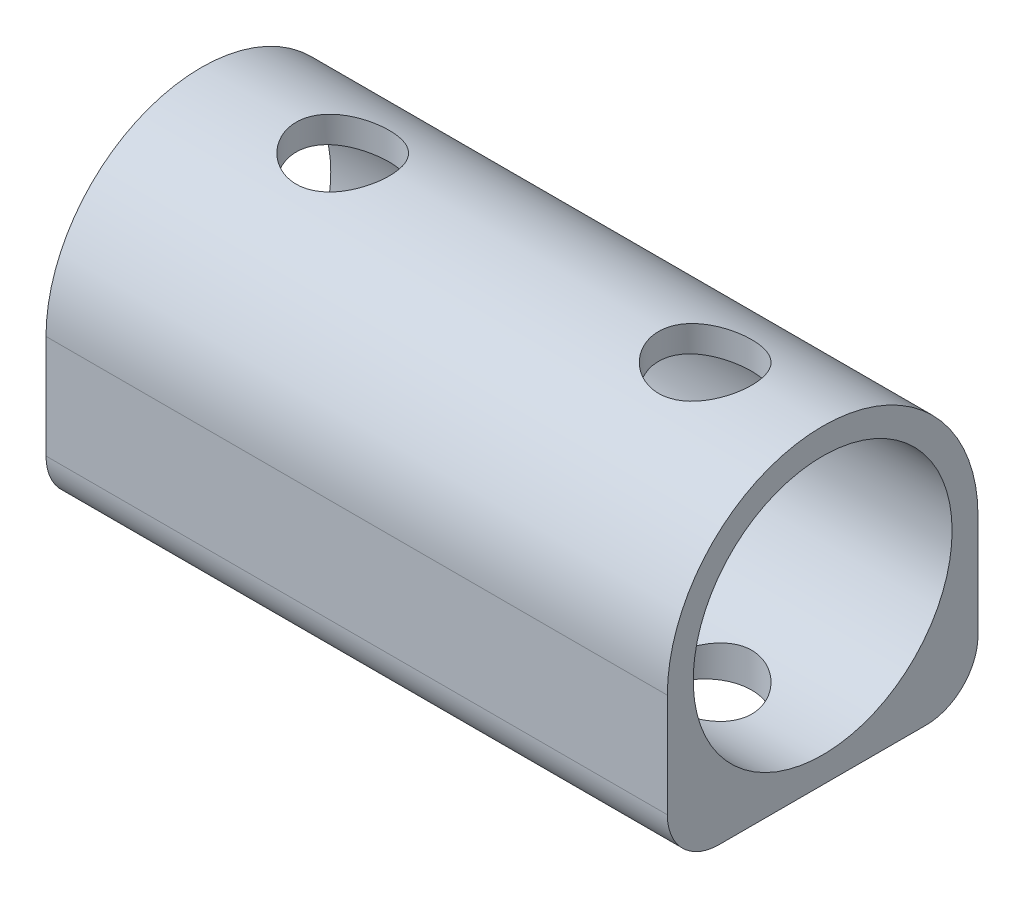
from build123d import *

# Parameters (mm, degrees)
BASE_EXTRUDE_DEPTH = 76.2
SKETCH3_R          = 15.875
CUT_EXTRUDE2_DEPTH = 81.82230509
SKETCH2_R          = 5.715
CUT_EXTRUDE1_DEPTH = 88.298066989
FILLET1_R          = 6.35


with BuildPart() as part:
    # Sketch1 → Base-Extrude (new body)
    with BuildSketch(Plane(origin=(0, 0, 0), x_dir=(0, 0, -1), z_dir=(1, 0, 0))):
        with BuildLine():
            Line((19.05, 0), (19.05, -19.05))
            Line((19.05, -19.05), (-19.05, -19.05))
            Line((-19.05, -19.05), (-19.05, 0))
            ThreePointArc((-19.05, 0), (0, 19.05), (19.05, 0))
        make_face()
    extrude(amount=-BASE_EXTRUDE_DEPTH)

    # Sketch3 → Cut-Extrude2 (cut, through all)
    with BuildSketch(Plane(origin=(0, 0, 0), x_dir=(0, 0, -1), z_dir=(1, 0, 0))):
        Circle(SKETCH3_R)
    extrude(amount=-CUT_EXTRUDE2_DEPTH, mode=Mode.SUBTRACT)

    # Sketch2 → Cut-Extrude1 (cut, through all)
    with BuildSketch(Plane.XZ.offset(19.05)):
        with Locations((-14.409818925, 0)):
            Circle(SKETCH2_R)
        with Locations((-58.859818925, 0)):
            Circle(SKETCH2_R)
    extrude(amount=-CUT_EXTRUDE1_DEPTH, mode=Mode.SUBTRACT)

    # Fillet1
    fillet1_edges = [part.edges().sort_by_distance(p)[0] for p in [
        (-38.1, -19.05, 19.05),
        (-38.1, -19.05, -19.05),
    ]]
    fillet(fillet1_edges, radius=FILLET1_R)


solid = part.part
